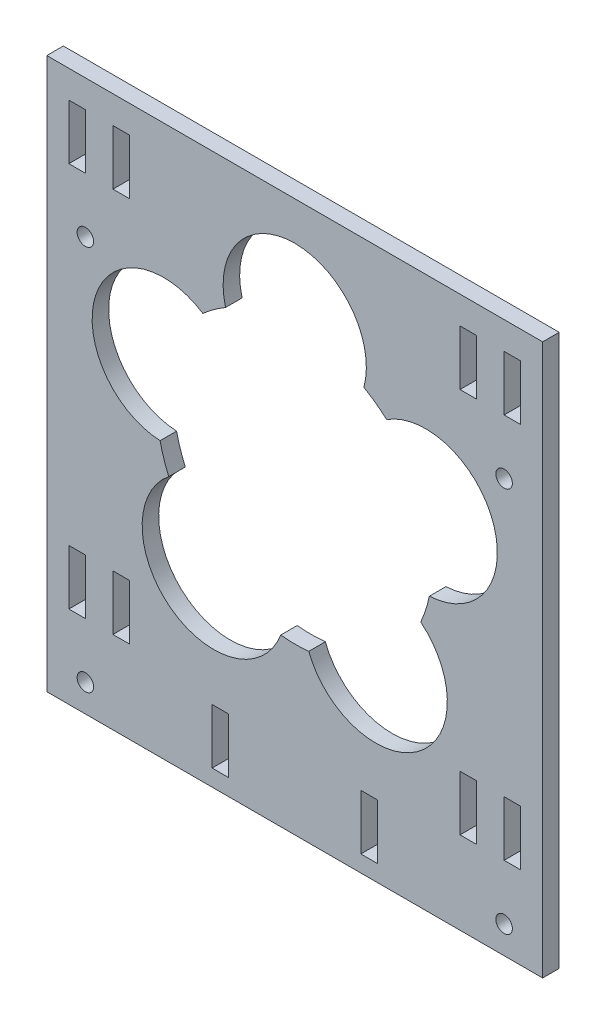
from build123d import *

# Parameters (mm, degrees)
EXTRUDE_2_DEPTH     = 3
SKETCH_5_W          = 3
SKETCH_5_H          = 10
CUT_EXTRUDE_1_DEPTH = 10
SKETCH_6_R          = 13
CUT_EXTRUDE_2_DEPTH = 10
SKETCH_7_R          = 7
SKETCH_7_R_2        = 1.5
CUT_EXTRUDE_3_DEPTH = 10
SKETCH_8_R          = 1.5
SKETCH_8_W          = 3
SKETCH_8_H          = 10
CUT_EXTRUDE_4_DEPTH = 10
SKETCH_9_R          = 25
CUT_EXTRUDE_5_DEPTH = 10


with BuildPart() as part:
    # Sketch 3 → Extrude 2 (new body)
    with BuildSketch(Plane.XY):
        Polygon((45, 45), (-45, 45), (-45, -45), (-45, -55), (45, -55), (45, -45), align=None)
    extrude(amount=EXTRUDE_2_DEPTH)

    # Sketch 5 → Cut-Extrude 1 (cut)
    with BuildSketch(Plane.XY.offset(3)):
        with Locations((-31.5, 35)):
            Rectangle(SKETCH_5_W, SKETCH_5_H)
        with Locations((31.5, 35)):
            Rectangle(SKETCH_5_W, SKETCH_5_H)
        with Locations((-31.5, -35)):
            Rectangle(SKETCH_5_W, SKETCH_5_H)
        with Locations((31.5, -35)):
            Rectangle(SKETCH_5_W, SKETCH_5_H)
    extrude(amount=-CUT_EXTRUDE_1_DEPTH, mode=Mode.SUBTRACT)

    # Sketch 6 → Cut-Extrude 2 (cut)
    with BuildSketch(Plane.XY.offset(3)):
        with Locations((0, 25)):
            Circle(SKETCH_6_R)
        with Locations((23.776412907, 7.725424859)):
            Circle(SKETCH_6_R)
        with Locations((14.694631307, -20.225424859)):
            Circle(SKETCH_6_R)
        with Locations((-14.694631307, -20.225424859)):
            Circle(SKETCH_6_R)
        with Locations((-23.776412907, 7.725424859)):
            Circle(SKETCH_6_R)
    extrude(amount=-CUT_EXTRUDE_2_DEPTH, mode=Mode.SUBTRACT)

    # Sketch 7 → Cut-Extrude 3 (cut)
    with BuildSketch(Plane.XY.offset(3)):
        Circle(SKETCH_7_R)
        with Locations((0, -9.5)):
            Circle(SKETCH_7_R_2)
        with Locations((-8.227241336, 4.75)):
            Circle(SKETCH_7_R_2)
        with Locations((8.227241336, 4.75)):
            Circle(SKETCH_7_R_2)
    extrude(amount=-CUT_EXTRUDE_3_DEPTH, mode=Mode.SUBTRACT)

    # Sketch 8 → Cut-Extrude 4 (cut)
    with BuildSketch(Plane.XY.offset(3)):
        with Locations((-38, -50)):
            Circle(SKETCH_8_R)
        with Locations((-38, 20)):
            Circle(SKETCH_8_R)
        with Locations((38, 20)):
            Circle(SKETCH_8_R)
        with Locations((38, -50)):
            Circle(SKETCH_8_R)
        with Locations((-39.5, -35)):
            Rectangle(SKETCH_8_W, SKETCH_8_H)
        with Locations((-39.5, 35)):
            Rectangle(SKETCH_8_W, SKETCH_8_H)
        with Locations((-13.5, -47)):
            Rectangle(SKETCH_8_W, SKETCH_8_H)
        with Locations((13.5, -47)):
            Rectangle(SKETCH_8_W, SKETCH_8_H)
        with Locations((39.5, 35)):
            Rectangle(SKETCH_8_W, SKETCH_8_H)
        with Locations((39.5, -35)):
            Rectangle(SKETCH_8_W, SKETCH_8_H)
    extrude(amount=-CUT_EXTRUDE_4_DEPTH, mode=Mode.SUBTRACT)

    # Sketch 9 → Cut-Extrude 5 (cut)
    with BuildSketch(Plane.XY.offset(3)):
        Circle(SKETCH_9_R)
    extrude(amount=-CUT_EXTRUDE_5_DEPTH, mode=Mode.SUBTRACT)


solid = part.part
